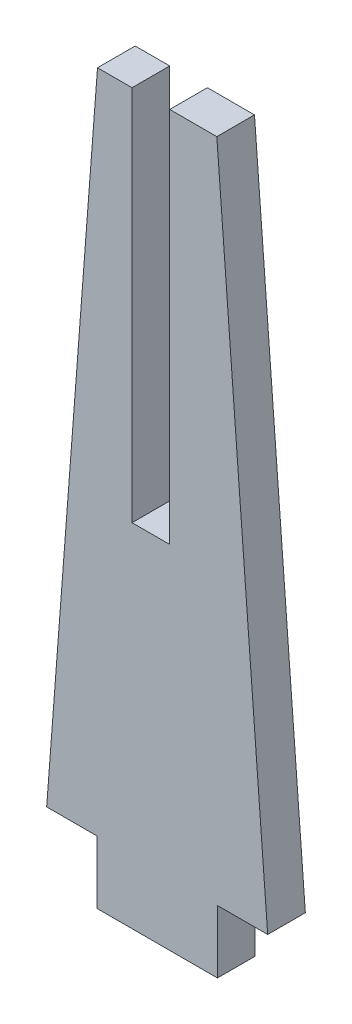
ISO-10303-21;
HEADER;
FILE_DESCRIPTION(('STEP AP214'),'2;1');
FILE_NAME('part.step','',(''),(''),'','','');
FILE_SCHEMA(('AUTOMOTIVE_DESIGN { 1 0 10303 214 1 1 1 1 }'));
ENDSEC;
DATA;
#1=APPLICATION_CONTEXT('core data for automotive mechanical design processes');
#2=APPLICATION_PROTOCOL_DEFINITION('international standard','automotive_design',2000,#1);
#3=PRODUCT_CONTEXT('',#1,'mechanical');
#4=PRODUCT('Part','Part','',(#3));
#5=PRODUCT_RELATED_PRODUCT_CATEGORY('part','',(#4));
#6=PRODUCT_DEFINITION_FORMATION('','',#4);
#7=PRODUCT_DEFINITION_CONTEXT('part definition',#1,'design');
#8=PRODUCT_DEFINITION('design','',#6,#7);
#9=PRODUCT_DEFINITION_SHAPE('','',#8);
#10=(LENGTH_UNIT() NAMED_UNIT(*) SI_UNIT(.MILLI.,.METRE.));
#11=(NAMED_UNIT(*) PLANE_ANGLE_UNIT() SI_UNIT($,.RADIAN.));
#12=(NAMED_UNIT(*) SI_UNIT($,.STERADIAN.) SOLID_ANGLE_UNIT());
#13=UNCERTAINTY_MEASURE_WITH_UNIT(LENGTH_MEASURE(1.E-05),#10,'distance_accuracy_value','');
#14=(GEOMETRIC_REPRESENTATION_CONTEXT(3) GLOBAL_UNCERTAINTY_ASSIGNED_CONTEXT((#13)) GLOBAL_UNIT_ASSIGNED_CONTEXT((#10,
#11,#12)) REPRESENTATION_CONTEXT('',''));
#15=CARTESIAN_POINT('',(0.,0.,0.));
#16=DIRECTION('',(0.,0.,1.));
#17=DIRECTION('',(1.,0.,0.));
#18=AXIS2_PLACEMENT_3D('',#15,#16,#17);
#19=CARTESIAN_POINT('',(0.999999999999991,0.,3.));
#20=DIRECTION('',(-1.,0.,0.));
#21=DIRECTION('',(0.,0.,1.));
#22=AXIS2_PLACEMENT_3D('',#19,#20,#21);
#23=PLANE('',#22);
#24=DIRECTION('',(0.,1.,0.));
#25=VECTOR('',#24,1.);
#26=CARTESIAN_POINT('',(0.999999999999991,0.,0.));
#27=LINE('',#26,#25);
#28=CARTESIAN_POINT('',(0.999999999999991,25.5,0.));
#29=VERTEX_POINT('',#28);
#30=CARTESIAN_POINT('',(0.999999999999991,55.5,0.));
#31=VERTEX_POINT('',#30);
#32=EDGE_CURVE('E168',#29,#31,#27,.T.);
#33=ORIENTED_EDGE('',*,*,#32,.F.);
#34=DIRECTION('',(0.,0.,-1.));
#35=VECTOR('',#34,1.);
#36=CARTESIAN_POINT('',(0.999999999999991,25.5,3.));
#37=LINE('',#36,#35);
#38=CARTESIAN_POINT('',(0.999999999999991,25.5,3.));
#39=VERTEX_POINT('',#38);
#40=EDGE_CURVE('E11',#39,#29,#37,.T.);
#41=ORIENTED_EDGE('',*,*,#40,.F.);
#42=DIRECTION('',(0.,1.,0.));
#43=VECTOR('',#42,1.);
#44=CARTESIAN_POINT('',(0.999999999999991,0.,3.));
#45=LINE('',#44,#43);
#46=CARTESIAN_POINT('',(0.999999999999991,55.5,3.));
#47=VERTEX_POINT('',#46);
#48=EDGE_CURVE('E209',#39,#47,#45,.T.);
#49=ORIENTED_EDGE('',*,*,#48,.T.);
#50=DIRECTION('',(0.,0.,-1.));
#51=VECTOR('',#50,1.);
#52=CARTESIAN_POINT('',(0.999999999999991,55.5,3.));
#53=LINE('',#52,#51);
#54=EDGE_CURVE('E62',#47,#31,#53,.T.);
#55=ORIENTED_EDGE('',*,*,#54,.T.);
#56=EDGE_LOOP('',(#33,#41,#49,#55));
#57=FACE_BOUND('',#56,.T.);
#58=ADVANCED_FACE('F45',(#57),#23,.T.);
#59=CARTESIAN_POINT('',(0.,25.5,3.));
#60=DIRECTION('',(0.,1.,0.));
#61=DIRECTION('',(0.,0.,1.));
#62=AXIS2_PLACEMENT_3D('',#59,#60,#61);
#63=PLANE('',#62);
#64=DIRECTION('',(1.,0.,0.));
#65=VECTOR('',#64,1.);
#66=CARTESIAN_POINT('',(0.,25.5,0.));
#67=LINE('',#66,#65);
#68=CARTESIAN_POINT('',(-2.,25.5,0.));
#69=VERTEX_POINT('',#68);
#70=EDGE_CURVE('E171',#69,#29,#67,.T.);
#71=ORIENTED_EDGE('',*,*,#70,.F.);
#72=DIRECTION('',(0.,0.,-1.));
#73=VECTOR('',#72,1.);
#74=CARTESIAN_POINT('',(-2.,25.5,3.));
#75=LINE('',#74,#73);
#76=CARTESIAN_POINT('',(-2.,25.5,3.));
#77=VERTEX_POINT('',#76);
#78=EDGE_CURVE('E54',#77,#69,#75,.T.);
#79=ORIENTED_EDGE('',*,*,#78,.F.);
#80=DIRECTION('',(1.,0.,0.));
#81=VECTOR('',#80,1.);
#82=CARTESIAN_POINT('',(0.,25.5,3.));
#83=LINE('',#82,#81);
#84=EDGE_CURVE('E250',#77,#39,#83,.T.);
#85=ORIENTED_EDGE('',*,*,#84,.T.);
#86=ORIENTED_EDGE('',*,*,#40,.T.);
#87=EDGE_LOOP('',(#71,#79,#85,#86));
#88=FACE_BOUND('',#87,.T.);
#89=ADVANCED_FACE('F249',(#88),#63,.T.);
#90=CARTESIAN_POINT('',(-2.,0.,3.));
#91=DIRECTION('',(-1.,0.,0.));
#92=DIRECTION('',(0.,0.,1.));
#93=AXIS2_PLACEMENT_3D('',#90,#91,#92);
#94=PLANE('',#93);
#95=DIRECTION('',(0.,1.,0.));
#96=VECTOR('',#95,1.);
#97=CARTESIAN_POINT('',(-2.,0.,0.));
#98=LINE('',#97,#96);
#99=CARTESIAN_POINT('',(-2.,55.5,0.));
#100=VERTEX_POINT('',#99);
#101=EDGE_CURVE('E175',#69,#100,#98,.T.);
#102=ORIENTED_EDGE('',*,*,#101,.T.);
#103=DIRECTION('',(0.,0.,-1.));
#104=VECTOR('',#103,1.);
#105=CARTESIAN_POINT('',(-2.,55.5,3.));
#106=LINE('',#105,#104);
#107=CARTESIAN_POINT('',(-2.,55.5,3.));
#108=VERTEX_POINT('',#107);
#109=EDGE_CURVE('E232',#108,#100,#106,.T.);
#110=ORIENTED_EDGE('',*,*,#109,.F.);
#111=DIRECTION('',(0.,1.,0.));
#112=VECTOR('',#111,1.);
#113=CARTESIAN_POINT('',(-2.,0.,3.));
#114=LINE('',#113,#112);
#115=EDGE_CURVE('E240',#77,#108,#114,.T.);
#116=ORIENTED_EDGE('',*,*,#115,.F.);
#117=ORIENTED_EDGE('',*,*,#78,.T.);
#118=EDGE_LOOP('',(#102,#110,#116,#117));
#119=FACE_BOUND('',#118,.T.);
#120=ADVANCED_FACE('F238',(#119),#94,.F.);
#121=CARTESIAN_POINT('',(0.,55.5,3.));
#122=DIRECTION('',(0.,1.,0.));
#123=DIRECTION('',(0.,0.,1.));
#124=AXIS2_PLACEMENT_3D('',#121,#122,#123);
#125=PLANE('',#124);
#126=DIRECTION('',(1.,0.,0.));
#127=VECTOR('',#126,1.);
#128=CARTESIAN_POINT('',(0.,55.5,0.));
#129=LINE('',#128,#127);
#130=CARTESIAN_POINT('',(-4.75,55.5,0.));
#131=VERTEX_POINT('',#130);
#132=EDGE_CURVE('E179',#131,#100,#129,.T.);
#133=ORIENTED_EDGE('',*,*,#132,.F.);
#134=DIRECTION('',(0.,0.,-1.));
#135=VECTOR('',#134,1.);
#136=CARTESIAN_POINT('',(-4.75,55.5,3.));
#137=LINE('',#136,#135);
#138=CARTESIAN_POINT('',(-4.75,55.5,3.));
#139=VERTEX_POINT('',#138);
#140=EDGE_CURVE('E229',#139,#131,#137,.T.);
#141=ORIENTED_EDGE('',*,*,#140,.F.);
#142=DIRECTION('',(1.,0.,0.));
#143=VECTOR('',#142,1.);
#144=CARTESIAN_POINT('',(0.,55.5,3.));
#145=LINE('',#144,#143);
#146=EDGE_CURVE('E318',#139,#108,#145,.T.);
#147=ORIENTED_EDGE('',*,*,#146,.T.);
#148=ORIENTED_EDGE('',*,*,#109,.T.);
#149=EDGE_LOOP('',(#133,#141,#147,#148));
#150=FACE_BOUND('',#149,.T.);
#151=ADVANCED_FACE('F268',(#150),#125,.T.);
#152=CARTESIAN_POINT('',(-8.93884145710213,0.683062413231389,3.));
#153=DIRECTION('',(0.997093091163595,-0.0761929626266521,0.));
#154=DIRECTION('',(0.0761929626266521,0.997093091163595,0.));
#155=AXIS2_PLACEMENT_3D('',#152,#153,#154);
#156=PLANE('',#155);
#157=DIRECTION('',(-0.0761929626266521,-0.997093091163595,0.));
#158=VECTOR('',#157,1.);
#159=CARTESIAN_POINT('',(-8.93884145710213,0.683062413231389,0.));
#160=LINE('',#159,#158);
#161=CARTESIAN_POINT('',(-8.8,2.5,0.));
#162=VERTEX_POINT('',#161);
#163=EDGE_CURVE('E183',#131,#162,#160,.T.);
#164=ORIENTED_EDGE('',*,*,#163,.T.);
#165=DIRECTION('',(0.,0.,-1.));
#166=VECTOR('',#165,1.);
#167=CARTESIAN_POINT('',(-8.8,2.5,3.));
#168=LINE('',#167,#166);
#169=CARTESIAN_POINT('',(-8.8,2.5,3.));
#170=VERTEX_POINT('',#169);
#171=EDGE_CURVE('E226',#170,#162,#168,.T.);
#172=ORIENTED_EDGE('',*,*,#171,.F.);
#173=DIRECTION('',(-0.0761929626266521,-0.997093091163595,0.));
#174=VECTOR('',#173,1.);
#175=CARTESIAN_POINT('',(-8.93884145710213,0.683062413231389,3.));
#176=LINE('',#175,#174);
#177=EDGE_CURVE('E314',#139,#170,#176,.T.);
#178=ORIENTED_EDGE('',*,*,#177,.F.);
#179=ORIENTED_EDGE('',*,*,#140,.T.);
#180=EDGE_LOOP('',(#164,#172,#178,#179));
#181=FACE_BOUND('',#180,.T.);
#182=ADVANCED_FACE('F273',(#181),#156,.F.);
#183=CARTESIAN_POINT('',(0.,2.5,3.));
#184=DIRECTION('',(0.,-1.,0.));
#185=DIRECTION('',(1.,0.,0.));
#186=AXIS2_PLACEMENT_3D('',#183,#184,#185);
#187=PLANE('',#186);
#188=DIRECTION('',(-1.,0.,0.));
#189=VECTOR('',#188,1.);
#190=CARTESIAN_POINT('',(0.,2.5,0.));
#191=LINE('',#190,#189);
#192=CARTESIAN_POINT('',(-4.8,2.5,0.));
#193=VERTEX_POINT('',#192);
#194=EDGE_CURVE('E187',#193,#162,#191,.T.);
#195=ORIENTED_EDGE('',*,*,#194,.F.);
#196=DIRECTION('',(0.,0.,-1.));
#197=VECTOR('',#196,1.);
#198=CARTESIAN_POINT('',(-4.8,2.5,3.));
#199=LINE('',#198,#197);
#200=CARTESIAN_POINT('',(-4.8,2.5,3.));
#201=VERTEX_POINT('',#200);
#202=EDGE_CURVE('E223',#201,#193,#199,.T.);
#203=ORIENTED_EDGE('',*,*,#202,.F.);
#204=DIRECTION('',(-1.,0.,0.));
#205=VECTOR('',#204,1.);
#206=CARTESIAN_POINT('',(0.,2.5,3.));
#207=LINE('',#206,#205);
#208=EDGE_CURVE('E158',#201,#170,#207,.T.);
#209=ORIENTED_EDGE('',*,*,#208,.T.);
#210=ORIENTED_EDGE('',*,*,#171,.T.);
#211=EDGE_LOOP('',(#195,#203,#209,#210));
#212=FACE_BOUND('',#211,.T.);
#213=ADVANCED_FACE('F277',(#212),#187,.T.);
#214=CARTESIAN_POINT('',(-4.8,0.,3.));
#215=DIRECTION('',(-1.,0.,0.));
#216=DIRECTION('',(0.,0.,1.));
#217=AXIS2_PLACEMENT_3D('',#214,#215,#216);
#218=PLANE('',#217);
#219=DIRECTION('',(0.,1.,0.));
#220=VECTOR('',#219,1.);
#221=CARTESIAN_POINT('',(-4.8,0.,0.));
#222=LINE('',#221,#220);
#223=CARTESIAN_POINT('',(-4.8,-2.5,0.));
#224=VERTEX_POINT('',#223);
#225=EDGE_CURVE('E191',#224,#193,#222,.T.);
#226=ORIENTED_EDGE('',*,*,#225,.F.);
#227=DIRECTION('',(0.,0.,-1.));
#228=VECTOR('',#227,1.);
#229=CARTESIAN_POINT('',(-4.8,-2.5,3.));
#230=LINE('',#229,#228);
#231=CARTESIAN_POINT('',(-4.8,-2.5,3.));
#232=VERTEX_POINT('',#231);
#233=EDGE_CURVE('E220',#232,#224,#230,.T.);
#234=ORIENTED_EDGE('',*,*,#233,.F.);
#235=DIRECTION('',(0.,1.,0.));
#236=VECTOR('',#235,1.);
#237=CARTESIAN_POINT('',(-4.8,0.,3.));
#238=LINE('',#237,#236);
#239=EDGE_CURVE('E308',#232,#201,#238,.T.);
#240=ORIENTED_EDGE('',*,*,#239,.T.);
#241=ORIENTED_EDGE('',*,*,#202,.T.);
#242=EDGE_LOOP('',(#226,#234,#240,#241));
#243=FACE_BOUND('',#242,.T.);
#244=ADVANCED_FACE('F279',(#243),#218,.T.);
#245=CARTESIAN_POINT('',(0.,-2.5,3.));
#246=DIRECTION('',(0.,1.,0.));
#247=DIRECTION('',(0.,0.,1.));
#248=AXIS2_PLACEMENT_3D('',#245,#246,#247);
#249=PLANE('',#248);
#250=DIRECTION('',(1.,0.,0.));
#251=VECTOR('',#250,1.);
#252=CARTESIAN_POINT('',(0.,-2.5,0.));
#253=LINE('',#252,#251);
#254=CARTESIAN_POINT('',(4.8,-2.5,0.));
#255=VERTEX_POINT('',#254);
#256=EDGE_CURVE('E195',#224,#255,#253,.T.);
#257=ORIENTED_EDGE('',*,*,#256,.T.);
#258=DIRECTION('',(0.,0.,-1.));
#259=VECTOR('',#258,1.);
#260=CARTESIAN_POINT('',(4.8,-2.5,3.));
#261=LINE('',#260,#259);
#262=CARTESIAN_POINT('',(4.8,-2.5,3.));
#263=VERTEX_POINT('',#262);
#264=EDGE_CURVE('E216',#263,#255,#261,.T.);
#265=ORIENTED_EDGE('',*,*,#264,.F.);
#266=DIRECTION('',(1.,0.,0.));
#267=VECTOR('',#266,1.);
#268=CARTESIAN_POINT('',(0.,-2.5,3.));
#269=LINE('',#268,#267);
#270=EDGE_CURVE('E310',#232,#263,#269,.T.);
#271=ORIENTED_EDGE('',*,*,#270,.F.);
#272=ORIENTED_EDGE('',*,*,#233,.T.);
#273=EDGE_LOOP('',(#257,#265,#271,#272));
#274=FACE_BOUND('',#273,.T.);
#275=ADVANCED_FACE('F282',(#274),#249,.F.);
#276=CARTESIAN_POINT('',(4.8,0.,3.));
#277=DIRECTION('',(-1.,0.,0.));
#278=DIRECTION('',(0.,0.,1.));
#279=AXIS2_PLACEMENT_3D('',#276,#277,#278);
#280=PLANE('',#279);
#281=DIRECTION('',(0.,1.,0.));
#282=VECTOR('',#281,1.);
#283=CARTESIAN_POINT('',(4.8,0.,0.));
#284=LINE('',#283,#282);
#285=CARTESIAN_POINT('',(4.8,2.5,0.));
#286=VERTEX_POINT('',#285);
#287=EDGE_CURVE('E198',#255,#286,#284,.T.);
#288=ORIENTED_EDGE('',*,*,#287,.T.);
#289=DIRECTION('',(0.,0.,-1.));
#290=VECTOR('',#289,1.);
#291=CARTESIAN_POINT('',(4.8,2.5,3.));
#292=LINE('',#291,#290);
#293=CARTESIAN_POINT('',(4.8,2.5,3.));
#294=VERTEX_POINT('',#293);
#295=EDGE_CURVE('E146',#294,#286,#292,.T.);
#296=ORIENTED_EDGE('',*,*,#295,.F.);
#297=DIRECTION('',(0.,1.,0.));
#298=VECTOR('',#297,1.);
#299=CARTESIAN_POINT('',(4.8,0.,3.));
#300=LINE('',#299,#298);
#301=EDGE_CURVE('E154',#263,#294,#300,.T.);
#302=ORIENTED_EDGE('',*,*,#301,.F.);
#303=ORIENTED_EDGE('',*,*,#264,.T.);
#304=EDGE_LOOP('',(#288,#296,#302,#303));
#305=FACE_BOUND('',#304,.T.);
#306=ADVANCED_FACE('F286',(#305),#280,.F.);
#307=CARTESIAN_POINT('',(8.8,2.5,0.));
#308=VERTEX_POINT('',#307);
#309=EDGE_CURVE('E141',#308,#286,#191,.T.);
#310=ORIENTED_EDGE('',*,*,#309,.F.);
#311=DIRECTION('',(0.,0.,-1.));
#312=VECTOR('',#311,1.);
#313=CARTESIAN_POINT('',(8.8,2.5,3.));
#314=LINE('',#313,#312);
#315=CARTESIAN_POINT('',(8.8,2.5,3.));
#316=VERTEX_POINT('',#315);
#317=EDGE_CURVE('E136',#316,#308,#314,.T.);
#318=ORIENTED_EDGE('',*,*,#317,.F.);
#319=EDGE_CURVE('E139',#316,#294,#207,.T.);
#320=ORIENTED_EDGE('',*,*,#319,.T.);
#321=ORIENTED_EDGE('',*,*,#295,.T.);
#322=EDGE_LOOP('',(#310,#318,#320,#321));
#323=FACE_BOUND('',#322,.T.);
#324=ADVANCED_FACE('F138',(#323),#187,.T.);
#325=CARTESIAN_POINT('',(8.93884145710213,0.683062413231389,3.));
#326=DIRECTION('',(0.997093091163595,0.0761929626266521,0.));
#327=DIRECTION('',(-0.0761929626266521,0.997093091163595,0.));
#328=AXIS2_PLACEMENT_3D('',#325,#326,#327);
#329=PLANE('',#328);
#330=DIRECTION('',(0.0761929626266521,-0.997093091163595,0.));
#331=VECTOR('',#330,1.);
#332=CARTESIAN_POINT('',(8.93884145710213,0.683062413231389,0.));
#333=LINE('',#332,#331);
#334=CARTESIAN_POINT('',(4.75,55.5,0.));
#335=VERTEX_POINT('',#334);
#336=EDGE_CURVE('E202',#335,#308,#333,.T.);
#337=ORIENTED_EDGE('',*,*,#336,.F.);
#338=DIRECTION('',(0.,0.,-1.));
#339=VECTOR('',#338,1.);
#340=CARTESIAN_POINT('',(4.75,55.5,3.));
#341=LINE('',#340,#339);
#342=CARTESIAN_POINT('',(4.75,55.5,3.));
#343=VERTEX_POINT('',#342);
#344=EDGE_CURVE('E99',#343,#335,#341,.T.);
#345=ORIENTED_EDGE('',*,*,#344,.F.);
#346=DIRECTION('',(0.0761929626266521,-0.997093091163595,0.));
#347=VECTOR('',#346,1.);
#348=CARTESIAN_POINT('',(8.93884145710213,0.683062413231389,3.));
#349=LINE('',#348,#347);
#350=EDGE_CURVE('E152',#343,#316,#349,.T.);
#351=ORIENTED_EDGE('',*,*,#350,.T.);
#352=ORIENTED_EDGE('',*,*,#317,.T.);
#353=EDGE_LOOP('',(#337,#345,#351,#352));
#354=FACE_BOUND('',#353,.T.);
#355=ADVANCED_FACE('F159',(#354),#329,.T.);
#356=CARTESIAN_POINT('',(0.,55.5,3.));
#357=DIRECTION('',(0.,1.,0.));
#358=DIRECTION('',(0.,0.,1.));
#359=AXIS2_PLACEMENT_3D('',#356,#357,#358);
#360=PLANE('',#359);
#361=DIRECTION('',(1.,0.,0.));
#362=VECTOR('',#361,1.);
#363=CARTESIAN_POINT('',(0.,55.5,0.));
#364=LINE('',#363,#362);
#365=EDGE_CURVE('E205',#31,#335,#364,.T.);
#366=ORIENTED_EDGE('',*,*,#365,.F.);
#367=ORIENTED_EDGE('',*,*,#54,.F.);
#368=DIRECTION('',(1.,0.,0.));
#369=VECTOR('',#368,1.);
#370=CARTESIAN_POINT('',(0.,55.5,3.));
#371=LINE('',#370,#369);
#372=EDGE_CURVE('E161',#47,#343,#371,.T.);
#373=ORIENTED_EDGE('',*,*,#372,.T.);
#374=ORIENTED_EDGE('',*,*,#344,.T.);
#375=EDGE_LOOP('',(#366,#367,#373,#374));
#376=FACE_BOUND('',#375,.T.);
#377=ADVANCED_FACE('F251',(#376),#360,.T.);
#378=CARTESIAN_POINT('',(0.,0.,3.));
#379=DIRECTION('',(0.,0.,1.));
#380=DIRECTION('',(1.,0.,0.));
#381=AXIS2_PLACEMENT_3D('',#378,#379,#380);
#382=PLANE('',#381);
#383=ORIENTED_EDGE('',*,*,#48,.F.);
#384=ORIENTED_EDGE('',*,*,#84,.F.);
#385=ORIENTED_EDGE('',*,*,#115,.T.);
#386=ORIENTED_EDGE('',*,*,#146,.F.);
#387=ORIENTED_EDGE('',*,*,#177,.T.);
#388=ORIENTED_EDGE('',*,*,#208,.F.);
#389=ORIENTED_EDGE('',*,*,#239,.F.);
#390=ORIENTED_EDGE('',*,*,#270,.T.);
#391=ORIENTED_EDGE('',*,*,#301,.T.);
#392=ORIENTED_EDGE('',*,*,#319,.F.);
#393=ORIENTED_EDGE('',*,*,#350,.F.);
#394=ORIENTED_EDGE('',*,*,#372,.F.);
#395=EDGE_LOOP('',(#383,#384,#385,#386,#387,#388,#389,#390,#391,#392,#393,#394));
#396=FACE_BOUND('',#395,.T.);
#397=ADVANCED_FACE('F150',(#396),#382,.T.);
#398=CARTESIAN_POINT('',(0.,0.,0.));
#399=DIRECTION('',(0.,0.,1.));
#400=DIRECTION('',(1.,0.,0.));
#401=AXIS2_PLACEMENT_3D('',#398,#399,#400);
#402=PLANE('',#401);
#403=ORIENTED_EDGE('',*,*,#32,.T.);
#404=ORIENTED_EDGE('',*,*,#365,.T.);
#405=ORIENTED_EDGE('',*,*,#336,.T.);
#406=ORIENTED_EDGE('',*,*,#309,.T.);
#407=ORIENTED_EDGE('',*,*,#287,.F.);
#408=ORIENTED_EDGE('',*,*,#256,.F.);
#409=ORIENTED_EDGE('',*,*,#225,.T.);
#410=ORIENTED_EDGE('',*,*,#194,.T.);
#411=ORIENTED_EDGE('',*,*,#163,.F.);
#412=ORIENTED_EDGE('',*,*,#132,.T.);
#413=ORIENTED_EDGE('',*,*,#101,.F.);
#414=ORIENTED_EDGE('',*,*,#70,.T.);
#415=EDGE_LOOP('',(#403,#404,#405,#406,#407,#408,#409,#410,#411,#412,#413,#414));
#416=FACE_BOUND('',#415,.T.);
#417=ADVANCED_FACE('F246',(#416),#402,.F.);
#418=CLOSED_SHELL('',(#58,#89,#120,#151,#182,#213,#244,#275,#306,#324,#355,#377,#397,#417));
#419=MANIFOLD_SOLID_BREP('B2',#418);
#420=ADVANCED_BREP_SHAPE_REPRESENTATION('',(#18,#419),#14);
#421=SHAPE_DEFINITION_REPRESENTATION(#9,#420);
ENDSEC;
END-ISO-10303-21;
